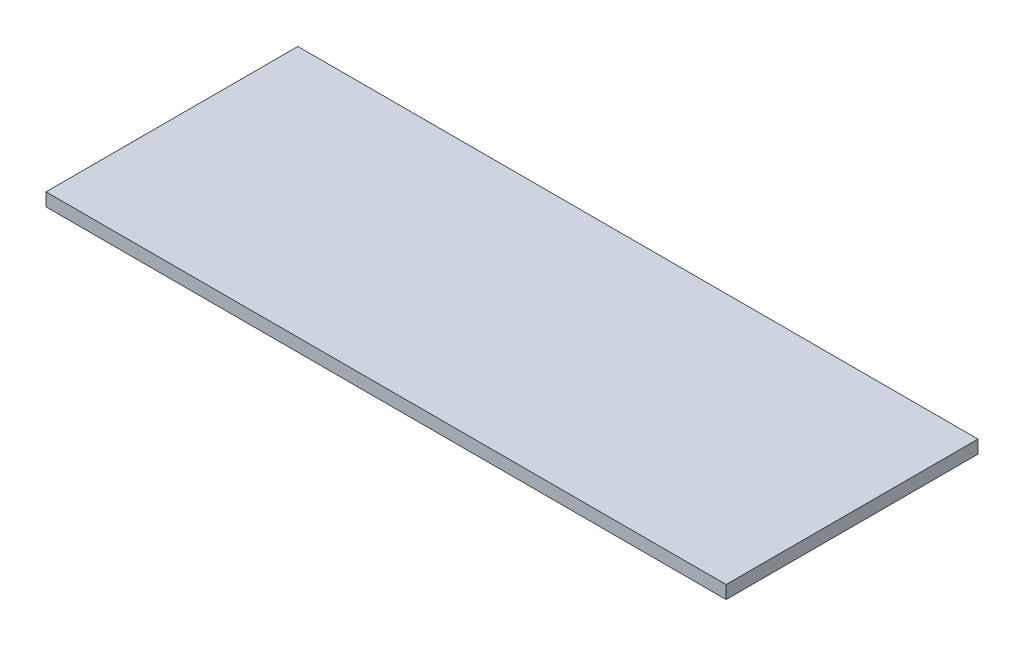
from build123d import *

# Parameters (mm, degrees)
SKETCH1_W           = 152.4
SKETCH1_H           = 56.4388
BOSS_EXTRUDE1_DEPTH = 2.921


with BuildPart() as part:
    # Sketch1 → Boss-Extrude1 (new body)
    with BuildSketch(Plane(origin=(0, 0, 0), x_dir=(1, 0, 0), z_dir=(0, 1, 0))):
        Rectangle(SKETCH1_W, SKETCH1_H)
    extrude(amount=BOSS_EXTRUDE1_DEPTH)


solid = part.part
